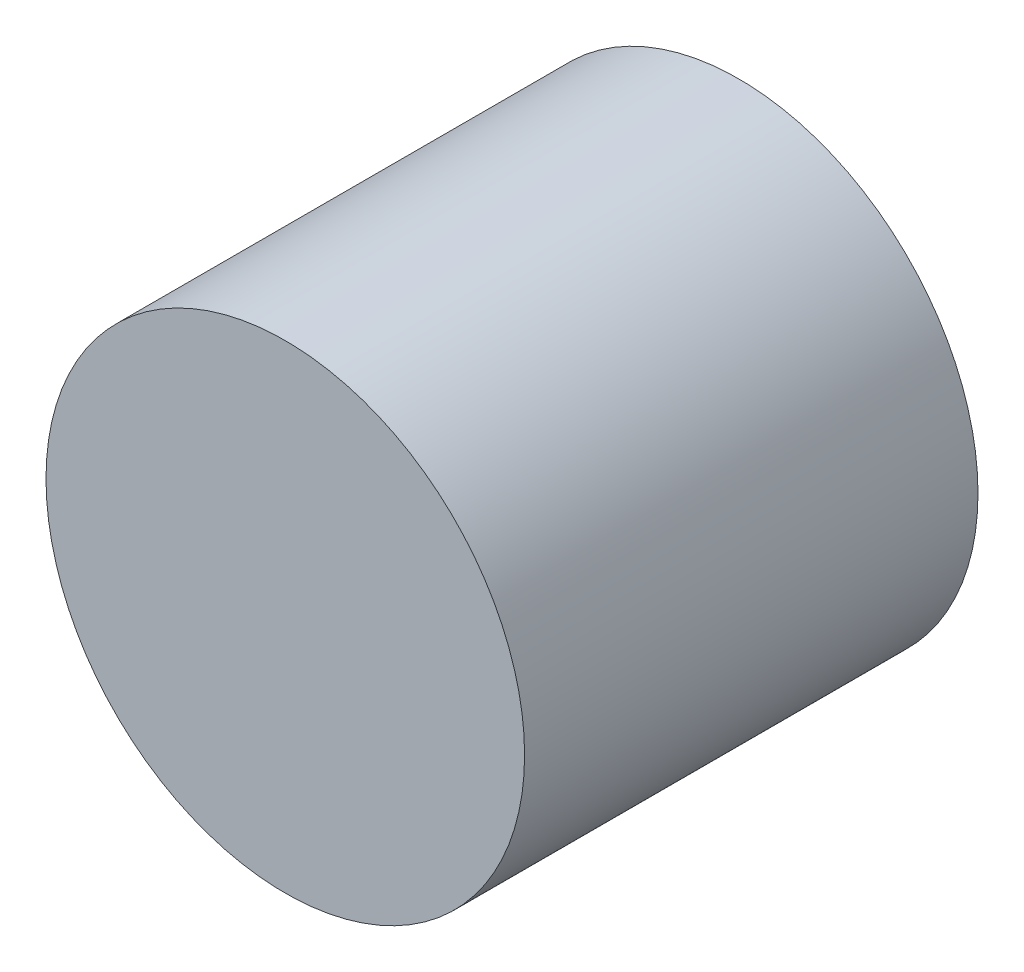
from build123d import *

# Parameters (mm, degrees)
SKETCH1_R          = 19
BASE_EXTRUDE_DEPTH = 36
SCALE1_SCALE       = 2.5
SCALE2_SCALE       = 1.2


with BuildPart() as part:
    # Sketch1 → Base-Extrude (new body)
    with BuildSketch(Plane.XY):
        Circle(SKETCH1_R)
    extrude(amount=BASE_EXTRUDE_DEPTH)


with BuildPart() as part_1:
    # Scale1: scaled about (0, 0, 18)
    add(part.part.scale(SCALE1_SCALE).moved(Location((0, 0, -27))))


with BuildPart() as part_2:
    # Scale2: scaled about (0, 0, 18)
    add(part_1.part.scale(SCALE2_SCALE).moved(Location((0, 0, -3.6))))


solid = part_2.part
